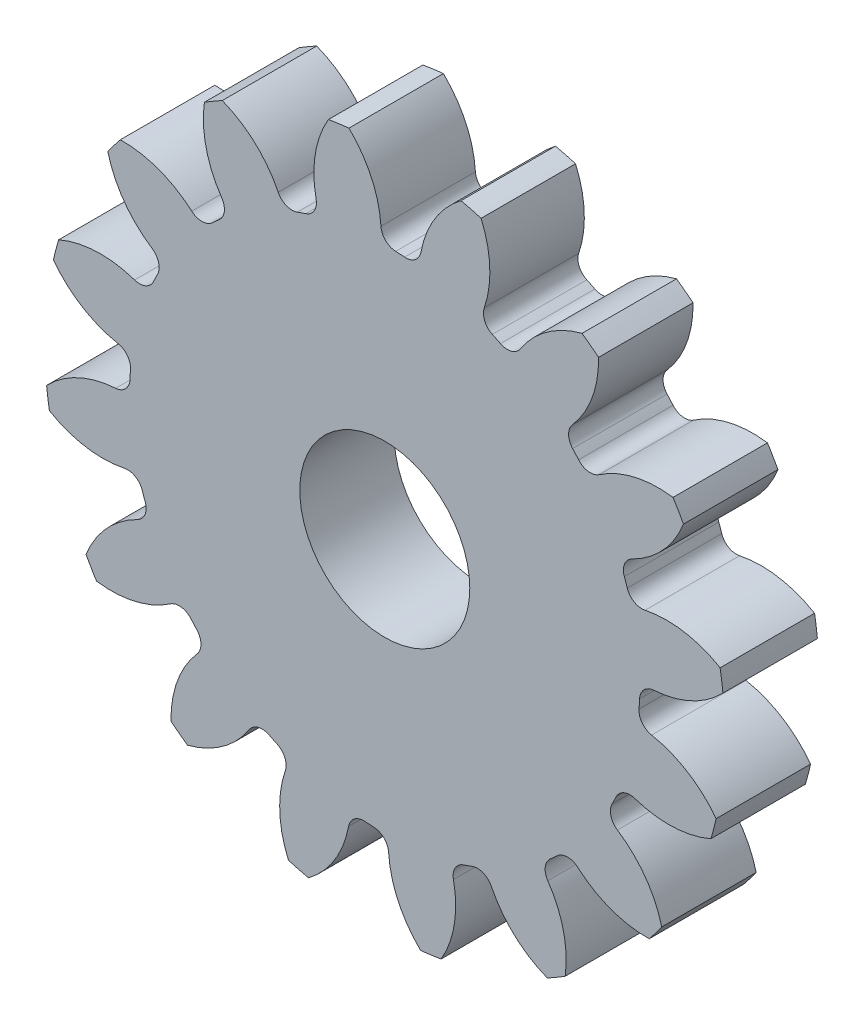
from build123d import *

# Parameters (mm, degrees)
SKETCH3_R         = 457.2
GEARBODY_DEPTH    = 127
TOOTHCUT_DEPTH    = 659.932985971
CIRPATTERN1_COUNT = 16
BOREDIA_R         = 114.3
BORE_DEPTH        = 12700


with BuildPart() as part:
    # Sketch3 → gearBody (new body)
    with BuildSketch(Plane.XY):
        Circle(SKETCH3_R)
    extrude(amount=GEARBODY_DEPTH)

    # Sketch2 → toothCut (cut, through all)
    with BuildSketch(Plane.XY):
        with BuildLine():
            ThreePointArc((341.858571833, -26.70443529), (342.276402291, -20.670617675), (342.587743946, -14.630369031))
            ThreePointArc((342.587743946, -14.630369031), (348.466833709, -1.052216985), (361.914168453, 5.120229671))
            ThreePointArc((361.914168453, 5.120229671), (413.996583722, 18.754998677), (457.2, 50.878973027))
            ThreePointArc((457.2, 50.878973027), (459.185696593, -27.730956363), (447.75417658, -105.530598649))
            ThreePointArc((447.75417658, -105.530598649), (408.730689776, -68.440810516), (358.667664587, -48.637315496))
            ThreePointArc((358.667664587, -48.637315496), (346.060880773, -40.891419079), (341.858571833, -26.70443529))
        make_face()
    toothcut = extrude(amount=TOOTHCUT_DEPTH, mode=Mode.SUBTRACT)

    # CirPattern1: toothCut ×16 about axis
    cirpattern1_axis = Axis((0, 0, 0), (0, 0, 1))
    for i in range(1, CIRPATTERN1_COUNT):
        add(toothcut.rotate(cirpattern1_axis, i * 360 / CIRPATTERN1_COUNT), mode=Mode.SUBTRACT)

    # boreDia → bore (cut, symmetric)
    with BuildSketch(Plane.XY):
        Circle(BOREDIA_R)
    extrude(amount=BORE_DEPTH, both=True, mode=Mode.SUBTRACT)


solid = part.part
